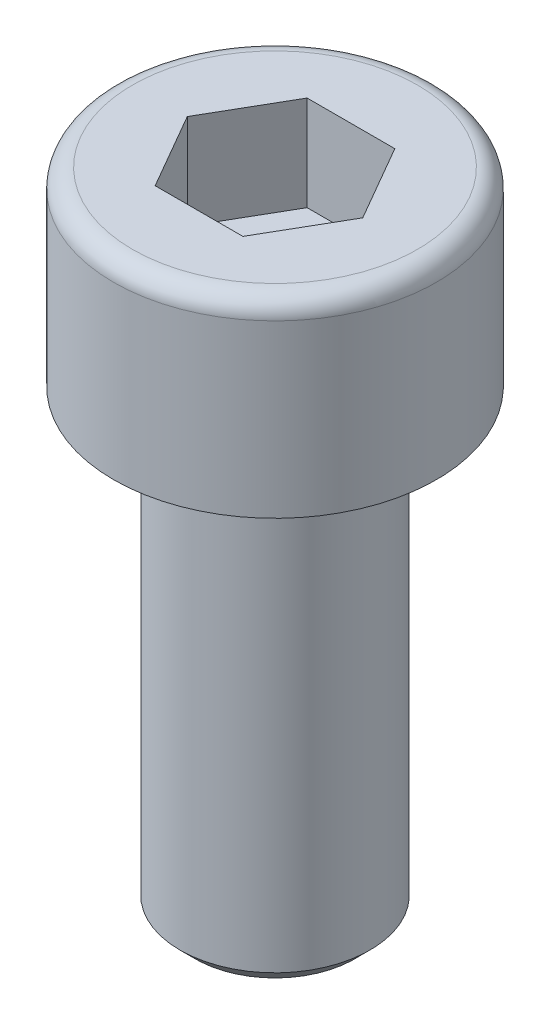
from build123d import *

# Parameters (mm, degrees)
ENL_V_MAT_EXTRU_1_DEPTH = 2.5
CHANFREIN1_SIZE         = 0.4


with BuildPart() as part:
    # Esquisse1 → Base-R_volution (revolve)
    with BuildSketch(Plane.XY, mode=Mode.PRIVATE) as base_r_volution_sk:
        with BuildLine():
            Line((0, 17), (-3.75, 17))
            ThreePointArc((-3.75, 17), (-4.103553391, 16.853553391), (-4.25, 16.5))
            Line((-4.25, 16.5), (-4.25, 12))
            Line((-4.25, 12), (-2.5, 12))
            Line((-2.5, 12), (-2.5, 0))
            Line((-2.5, 0), (0, 0))
            Line((0, 0), (0, 17))
        make_face()
    revolve(base_r_volution_sk.sketch.rotate(Axis((0, 50, 0), (0, -1, 0)), 270), axis=Axis((0, 50, 0), (0, -1, 0)))

    # Esquisse2 → Enl_v. mat.-Extru.1 (cut)
    with BuildSketch(Plane(origin=(0, 17, 0), x_dir=(-1, 0, 0), z_dir=(0, 1, 0))):
        Polygon((-1.154700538, -2), (1.154700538, -2), (2.309401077, 0), (1.154700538, 2), (-1.154700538, 2), (-2.309401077, 0), align=None)
    extrude(amount=-ENL_V_MAT_EXTRU_1_DEPTH, mode=Mode.SUBTRACT)

    # Chanfrein1
    chanfrein1_edges = [part.edges().sort_by_distance(p)[0] for p in [
        (0, 0, -2.5),
    ]]
    chamfer(chanfrein1_edges, length=CHANFREIN1_SIZE)


solid = part.part
